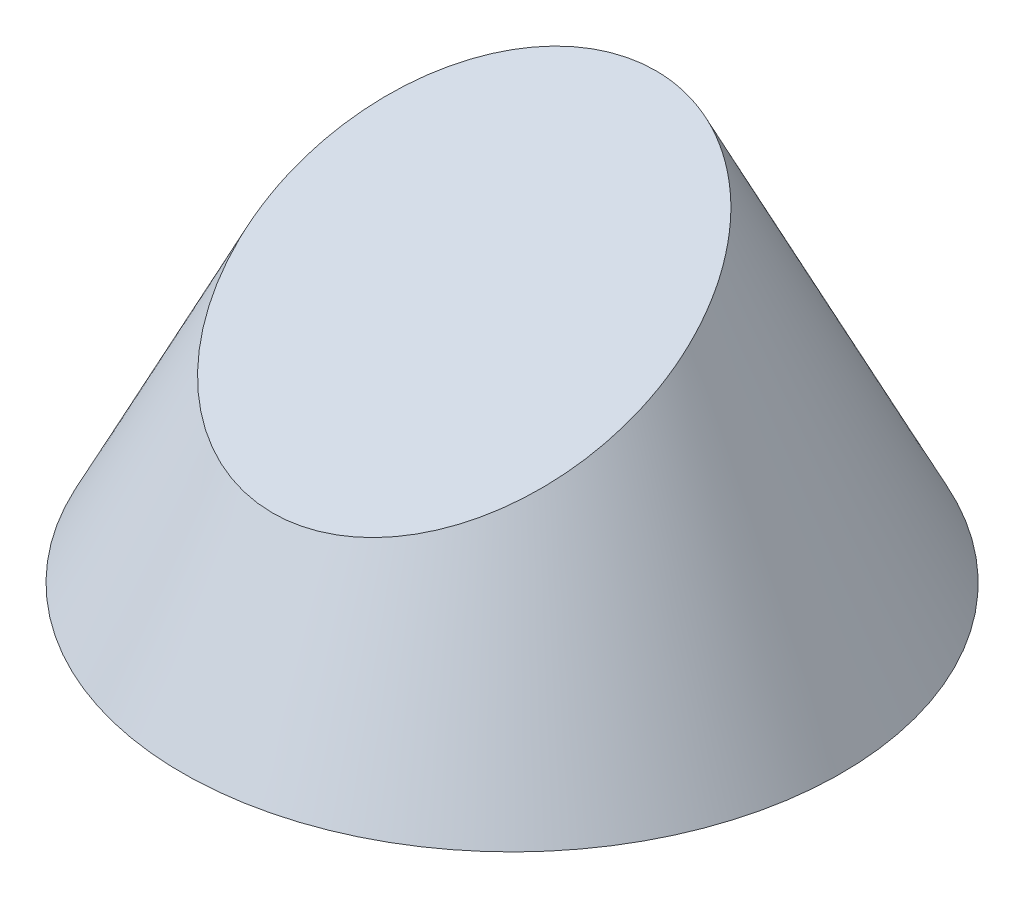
from build123d import *

# Parameters (mm, degrees)
CUT_EXTRUDE_1_DEPTH      = 49.989794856
CUT_EXTRUDE_1_DEPTH_BACK = 49.989794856


with BuildPart() as part:
    # Sketch 1 → Revolve 1 (revolve)
    with BuildSketch(Plane(origin=(0, 0, 0), x_dir=(0, 0, -1), z_dir=(1, 0, 0))):
        Polygon((0, 0), (20, 0), (0, 40), align=None)
    revolve(axis=Axis((0, 0, 0), (0, 1, 0)))

    # Sketch 3 → Cut-Extrude 1 (cut, two sides: drawn at the far end of the back side and taken through both)
    with BuildSketch(Plane(origin=(0, 0, 0), x_dir=(0, 0, -1), z_dir=(1, 0, 0)).offset(-CUT_EXTRUDE_1_DEPTH_BACK)):
        Polygon((-14.532305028, 10.935389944), (8.719383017, 22.561233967), (8.719383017, 45.224446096), (-14.532305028, 45.224446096), align=None)
    extrude(amount=CUT_EXTRUDE_1_DEPTH + CUT_EXTRUDE_1_DEPTH_BACK, mode=Mode.SUBTRACT)


solid = part.part
